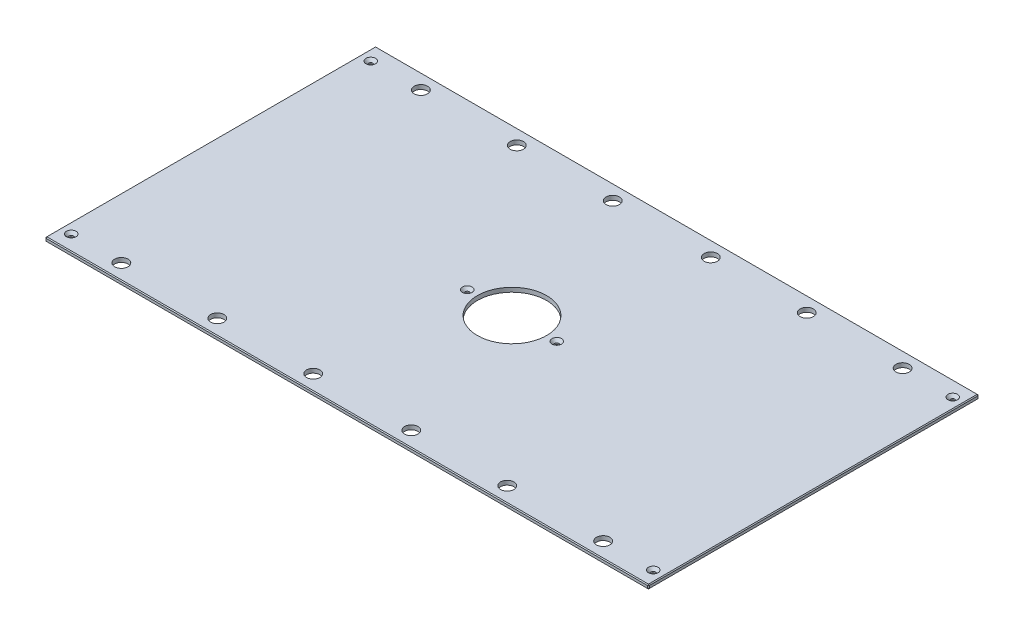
ISO-10303-21;
HEADER;
FILE_DESCRIPTION(('STEP AP214'),'2;1');
FILE_NAME('part.step','',(''),(''),'','','');
FILE_SCHEMA(('AUTOMOTIVE_DESIGN { 1 0 10303 214 1 1 1 1 }'));
ENDSEC;
DATA;
#1=APPLICATION_CONTEXT('core data for automotive mechanical design processes');
#2=APPLICATION_PROTOCOL_DEFINITION('international standard','automotive_design',2000,#1);
#3=PRODUCT_CONTEXT('',#1,'mechanical');
#4=PRODUCT('Part','Part','',(#3));
#5=PRODUCT_RELATED_PRODUCT_CATEGORY('part','',(#4));
#6=PRODUCT_DEFINITION_FORMATION('','',#4);
#7=PRODUCT_DEFINITION_CONTEXT('part definition',#1,'design');
#8=PRODUCT_DEFINITION('design','',#6,#7);
#9=PRODUCT_DEFINITION_SHAPE('','',#8);
#10=(LENGTH_UNIT() NAMED_UNIT(*) SI_UNIT(.MILLI.,.METRE.));
#11=(NAMED_UNIT(*) PLANE_ANGLE_UNIT() SI_UNIT($,.RADIAN.));
#12=(NAMED_UNIT(*) SI_UNIT($,.STERADIAN.) SOLID_ANGLE_UNIT());
#13=UNCERTAINTY_MEASURE_WITH_UNIT(LENGTH_MEASURE(1.E-05),#10,'distance_accuracy_value','');
#14=(GEOMETRIC_REPRESENTATION_CONTEXT(3) GLOBAL_UNCERTAINTY_ASSIGNED_CONTEXT((#13)) GLOBAL_UNIT_ASSIGNED_CONTEXT((#10,
#11,#12)) REPRESENTATION_CONTEXT('',''));
#15=CARTESIAN_POINT('',(0.,0.,0.));
#16=DIRECTION('',(0.,0.,1.));
#17=DIRECTION('',(1.,0.,0.));
#18=AXIS2_PLACEMENT_3D('',#15,#16,#17);
#19=CARTESIAN_POINT('',(-449.2625,6.35,-246.0625));
#20=DIRECTION('',(1.,0.,0.));
#21=DIRECTION('',(0.,0.,-1.));
#22=AXIS2_PLACEMENT_3D('',#19,#20,#21);
#23=PLANE('',#22);
#24=DIRECTION('',(0.,0.,-1.));
#25=VECTOR('',#24,1.);
#26=CARTESIAN_POINT('',(-449.2625,5.08000000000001,-246.0625));
#27=LINE('',#26,#25);
#28=CARTESIAN_POINT('',(-449.2625,5.08000000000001,244.7925));
#29=VERTEX_POINT('',#28);
#30=CARTESIAN_POINT('',(-449.2625,5.08000000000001,-244.7925));
#31=VERTEX_POINT('',#30);
#32=EDGE_CURVE('E140',#29,#31,#27,.T.);
#33=ORIENTED_EDGE('',*,*,#32,.T.);
#34=DIRECTION('',(0.,-1.,0.));
#35=VECTOR('',#34,1.);
#36=CARTESIAN_POINT('',(-449.2625,6.35,-244.7925));
#37=LINE('',#36,#35);
#38=CARTESIAN_POINT('',(-449.2625,1.26999999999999,-244.7925));
#39=VERTEX_POINT('',#38);
#40=EDGE_CURVE('E135',#31,#39,#37,.T.);
#41=ORIENTED_EDGE('',*,*,#40,.T.);
#42=DIRECTION('',(0.,0.,1.));
#43=VECTOR('',#42,1.);
#44=CARTESIAN_POINT('',(-449.2625,1.26999999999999,-246.0625));
#45=LINE('',#44,#43);
#46=CARTESIAN_POINT('',(-449.2625,1.26999999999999,244.7925));
#47=VERTEX_POINT('',#46);
#48=EDGE_CURVE('E130',#39,#47,#45,.T.);
#49=ORIENTED_EDGE('',*,*,#48,.T.);
#50=DIRECTION('',(0.,1.,0.));
#51=VECTOR('',#50,1.);
#52=CARTESIAN_POINT('',(-449.2625,6.35,244.7925));
#53=LINE('',#52,#51);
#54=EDGE_CURVE('E132',#47,#29,#53,.T.);
#55=ORIENTED_EDGE('',*,*,#54,.T.);
#56=EDGE_LOOP('',(#33,#41,#49,#55));
#57=FACE_BOUND('',#56,.T.);
#58=ADVANCED_FACE('F38',(#57),#23,.F.);
#59=CARTESIAN_POINT('',(-449.2625,6.35,246.0625));
#60=DIRECTION('',(0.,0.,-1.));
#61=DIRECTION('',(-1.,0.,0.));
#62=AXIS2_PLACEMENT_3D('',#59,#60,#61);
#63=PLANE('',#62);
#64=DIRECTION('',(1.,0.,0.));
#65=VECTOR('',#64,1.);
#66=CARTESIAN_POINT('',(-449.2625,1.26999999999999,246.0625));
#67=LINE('',#66,#65);
#68=CARTESIAN_POINT('',(-447.9925,1.26999999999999,246.0625));
#69=VERTEX_POINT('',#68);
#70=CARTESIAN_POINT('',(447.9925,1.26999999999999,246.0625));
#71=VERTEX_POINT('',#70);
#72=EDGE_CURVE('E62',#69,#71,#67,.T.);
#73=ORIENTED_EDGE('',*,*,#72,.T.);
#74=DIRECTION('',(0.,1.,0.));
#75=VECTOR('',#74,1.);
#76=CARTESIAN_POINT('',(447.9925,6.35,246.0625));
#77=LINE('',#76,#75);
#78=CARTESIAN_POINT('',(447.9925,5.08000000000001,246.0625));
#79=VERTEX_POINT('',#78);
#80=EDGE_CURVE('E11',#71,#79,#77,.T.);
#81=ORIENTED_EDGE('',*,*,#80,.T.);
#82=DIRECTION('',(-1.,0.,0.));
#83=VECTOR('',#82,1.);
#84=CARTESIAN_POINT('',(-449.2625,5.08000000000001,246.0625));
#85=LINE('',#84,#83);
#86=CARTESIAN_POINT('',(-447.9925,5.08000000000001,246.0625));
#87=VERTEX_POINT('',#86);
#88=EDGE_CURVE('E48',#79,#87,#85,.T.);
#89=ORIENTED_EDGE('',*,*,#88,.T.);
#90=DIRECTION('',(0.,-1.,0.));
#91=VECTOR('',#90,1.);
#92=CARTESIAN_POINT('',(-447.9925,6.35,246.0625));
#93=LINE('',#92,#91);
#94=EDGE_CURVE('E398',#87,#69,#93,.T.);
#95=ORIENTED_EDGE('',*,*,#94,.T.);
#96=EDGE_LOOP('',(#73,#81,#89,#95));
#97=FACE_BOUND('',#96,.T.);
#98=ADVANCED_FACE('F473',(#97),#63,.F.);
#99=CARTESIAN_POINT('',(449.2625,6.35,-246.0625));
#100=DIRECTION('',(-1.,0.,0.));
#101=DIRECTION('',(0.,0.,1.));
#102=AXIS2_PLACEMENT_3D('',#99,#100,#101);
#103=PLANE('',#102);
#104=DIRECTION('',(0.,0.,-1.));
#105=VECTOR('',#104,1.);
#106=CARTESIAN_POINT('',(449.2625,1.26999999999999,-246.0625));
#107=LINE('',#106,#105);
#108=CARTESIAN_POINT('',(449.2625,1.26999999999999,244.7925));
#109=VERTEX_POINT('',#108);
#110=CARTESIAN_POINT('',(449.2625,1.26999999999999,-244.7925));
#111=VERTEX_POINT('',#110);
#112=EDGE_CURVE('E391',#109,#111,#107,.T.);
#113=ORIENTED_EDGE('',*,*,#112,.T.);
#114=DIRECTION('',(0.,1.,0.));
#115=VECTOR('',#114,1.);
#116=CARTESIAN_POINT('',(449.2625,6.35,-244.7925));
#117=LINE('',#116,#115);
#118=CARTESIAN_POINT('',(449.2625,5.08000000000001,-244.7925));
#119=VERTEX_POINT('',#118);
#120=EDGE_CURVE('E394',#111,#119,#117,.T.);
#121=ORIENTED_EDGE('',*,*,#120,.T.);
#122=DIRECTION('',(0.,0.,1.));
#123=VECTOR('',#122,1.);
#124=CARTESIAN_POINT('',(449.2625,5.08000000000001,246.0625));
#125=LINE('',#124,#123);
#126=CARTESIAN_POINT('',(449.2625,5.08000000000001,244.7925));
#127=VERTEX_POINT('',#126);
#128=EDGE_CURVE('E388',#119,#127,#125,.T.);
#129=ORIENTED_EDGE('',*,*,#128,.T.);
#130=DIRECTION('',(0.,-1.,0.));
#131=VECTOR('',#130,1.);
#132=CARTESIAN_POINT('',(449.2625,6.35,244.7925));
#133=LINE('',#132,#131);
#134=EDGE_CURVE('E385',#127,#109,#133,.T.);
#135=ORIENTED_EDGE('',*,*,#134,.T.);
#136=EDGE_LOOP('',(#113,#121,#129,#135));
#137=FACE_BOUND('',#136,.T.);
#138=ADVANCED_FACE('F460',(#137),#103,.F.);
#139=CARTESIAN_POINT('',(-449.2625,6.35,-246.0625));
#140=DIRECTION('',(0.,0.,1.));
#141=DIRECTION('',(1.,0.,0.));
#142=AXIS2_PLACEMENT_3D('',#139,#140,#141);
#143=PLANE('',#142);
#144=DIRECTION('',(-1.,0.,0.));
#145=VECTOR('',#144,1.);
#146=CARTESIAN_POINT('',(-449.2625,1.26999999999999,-246.0625));
#147=LINE('',#146,#145);
#148=CARTESIAN_POINT('',(447.9925,1.26999999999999,-246.0625));
#149=VERTEX_POINT('',#148);
#150=CARTESIAN_POINT('',(-447.9925,1.26999999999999,-246.0625));
#151=VERTEX_POINT('',#150);
#152=EDGE_CURVE('E350',#149,#151,#147,.T.);
#153=ORIENTED_EDGE('',*,*,#152,.T.);
#154=DIRECTION('',(0.,1.,0.));
#155=VECTOR('',#154,1.);
#156=CARTESIAN_POINT('',(-447.9925,6.35,-246.0625));
#157=LINE('',#156,#155);
#158=CARTESIAN_POINT('',(-447.9925,5.08000000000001,-246.0625));
#159=VERTEX_POINT('',#158);
#160=EDGE_CURVE('E356',#151,#159,#157,.T.);
#161=ORIENTED_EDGE('',*,*,#160,.T.);
#162=DIRECTION('',(1.,0.,0.));
#163=VECTOR('',#162,1.);
#164=CARTESIAN_POINT('',(449.2625,5.08000000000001,-246.0625));
#165=LINE('',#164,#163);
#166=CARTESIAN_POINT('',(447.9925,5.08000000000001,-246.0625));
#167=VERTEX_POINT('',#166);
#168=EDGE_CURVE('E353',#159,#167,#165,.T.);
#169=ORIENTED_EDGE('',*,*,#168,.T.);
#170=DIRECTION('',(0.,-1.,0.));
#171=VECTOR('',#170,1.);
#172=CARTESIAN_POINT('',(447.9925,6.35,-246.0625));
#173=LINE('',#172,#171);
#174=EDGE_CURVE('E347',#167,#149,#173,.T.);
#175=ORIENTED_EDGE('',*,*,#174,.T.);
#176=EDGE_LOOP('',(#153,#161,#169,#175));
#177=FACE_BOUND('',#176,.T.);
#178=ADVANCED_FACE('F434',(#177),#143,.F.);
#179=CARTESIAN_POINT('',(0.,6.35,0.));
#180=DIRECTION('',(0.,1.,0.));
#181=DIRECTION('',(0.,0.,1.));
#182=AXIS2_PLACEMENT_3D('',#179,#180,#181);
#183=PLANE('',#182);
#184=CARTESIAN_POINT('',(433.3875,6.35,-223.04248));
#185=DIRECTION('',(0.,1.,0.));
#186=DIRECTION('',(0.,0.,1.));
#187=AXIS2_PLACEMENT_3D('',#184,#185,#186);
#188=CIRCLE('',#187,7.13740000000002);
#189=CARTESIAN_POINT('',(433.3875,6.35,-215.90508));
#190=VERTEX_POINT('',#189);
#191=EDGE_CURVE('E1069',#190,#190,#188,.T.);
#192=ORIENTED_EDGE('',*,*,#191,.F.);
#193=EDGE_LOOP('',(#192));
#194=FACE_BOUND('',#193,.T.);
#195=CARTESIAN_POINT('',(433.3875,6.35,223.04248));
#196=DIRECTION('',(0.,1.,0.));
#197=DIRECTION('',(0.,0.,1.));
#198=AXIS2_PLACEMENT_3D('',#195,#196,#197);
#199=CIRCLE('',#198,7.13740000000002);
#200=CARTESIAN_POINT('',(433.3875,6.35,230.17988));
#201=VERTEX_POINT('',#200);
#202=EDGE_CURVE('E1073',#201,#201,#199,.T.);
#203=ORIENTED_EDGE('',*,*,#202,.F.);
#204=EDGE_LOOP('',(#203));
#205=FACE_BOUND('',#204,.T.);
#206=CARTESIAN_POINT('',(-433.3875,6.35,223.04248));
#207=DIRECTION('',(0.,1.,0.));
#208=DIRECTION('',(0.,0.,1.));
#209=AXIS2_PLACEMENT_3D('',#206,#207,#208);
#210=CIRCLE('',#209,7.13740000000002);
#211=CARTESIAN_POINT('',(-433.3875,6.35,230.17988));
#212=VERTEX_POINT('',#211);
#213=EDGE_CURVE('E1077',#212,#212,#210,.T.);
#214=ORIENTED_EDGE('',*,*,#213,.F.);
#215=EDGE_LOOP('',(#214));
#216=FACE_BOUND('',#215,.T.);
#217=CARTESIAN_POINT('',(-66.675,6.35,0.));
#218=DIRECTION('',(0.,1.,0.));
#219=DIRECTION('',(0.,0.,1.));
#220=AXIS2_PLACEMENT_3D('',#217,#218,#219);
#221=CIRCLE('',#220,7.1374);
#222=CARTESIAN_POINT('',(-66.675,6.35,7.1374));
#223=VERTEX_POINT('',#222);
#224=EDGE_CURVE('E1081',#223,#223,#221,.T.);
#225=ORIENTED_EDGE('',*,*,#224,.F.);
#226=EDGE_LOOP('',(#225));
#227=FACE_BOUND('',#226,.T.);
#228=CARTESIAN_POINT('',(66.675,6.35,0.));
#229=DIRECTION('',(0.,1.,0.));
#230=DIRECTION('',(0.,0.,1.));
#231=AXIS2_PLACEMENT_3D('',#228,#229,#230);
#232=CIRCLE('',#231,7.1374);
#233=CARTESIAN_POINT('',(66.675,6.35,7.1374));
#234=VERTEX_POINT('',#233);
#235=EDGE_CURVE('E1085',#234,#234,#232,.T.);
#236=ORIENTED_EDGE('',*,*,#235,.F.);
#237=EDGE_LOOP('',(#236));
#238=FACE_BOUND('',#237,.T.);
#239=CARTESIAN_POINT('',(-433.3875,6.35,-223.04248));
#240=DIRECTION('',(0.,1.,0.));
#241=DIRECTION('',(0.,0.,1.));
#242=AXIS2_PLACEMENT_3D('',#239,#240,#241);
#243=CIRCLE('',#242,7.13740000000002);
#244=CARTESIAN_POINT('',(-433.3875,6.35,-215.90508));
#245=VERTEX_POINT('',#244);
#246=EDGE_CURVE('E1088',#245,#245,#243,.T.);
#247=ORIENTED_EDGE('',*,*,#246,.F.);
#248=EDGE_LOOP('',(#247));
#249=FACE_BOUND('',#248,.T.);
#250=DIRECTION('',(0.,0.,-1.));
#251=VECTOR('',#250,1.);
#252=CARTESIAN_POINT('',(447.9925,6.35,-246.0625));
#253=LINE('',#252,#251);
#254=CARTESIAN_POINT('',(447.9925,6.35,244.7925));
#255=VERTEX_POINT('',#254);
#256=CARTESIAN_POINT('',(447.9925,6.35,-244.7925));
#257=VERTEX_POINT('',#256);
#258=EDGE_CURVE('E366',#255,#257,#253,.T.);
#259=ORIENTED_EDGE('',*,*,#258,.T.);
#260=DIRECTION('',(-1.,0.,0.));
#261=VECTOR('',#260,1.);
#262=CARTESIAN_POINT('',(-449.2625,6.35,-244.7925));
#263=LINE('',#262,#261);
#264=CARTESIAN_POINT('',(-447.9925,6.35,-244.7925));
#265=VERTEX_POINT('',#264);
#266=EDGE_CURVE('E369',#257,#265,#263,.T.);
#267=ORIENTED_EDGE('',*,*,#266,.T.);
#268=DIRECTION('',(0.,0.,1.));
#269=VECTOR('',#268,1.);
#270=CARTESIAN_POINT('',(-447.9925,6.35,246.0625));
#271=LINE('',#270,#269);
#272=CARTESIAN_POINT('',(-447.9925,6.35,244.7925));
#273=VERTEX_POINT('',#272);
#274=EDGE_CURVE('E363',#265,#273,#271,.T.);
#275=ORIENTED_EDGE('',*,*,#274,.T.);
#276=DIRECTION('',(1.,0.,0.));
#277=VECTOR('',#276,1.);
#278=CARTESIAN_POINT('',(449.2625,6.35,244.7925));
#279=LINE('',#278,#277);
#280=EDGE_CURVE('E360',#273,#255,#279,.T.);
#281=ORIENTED_EDGE('',*,*,#280,.T.);
#282=EDGE_LOOP('',(#259,#267,#275,#281));
#283=FACE_BOUND('',#282,.T.);
#284=CARTESIAN_POINT('',(358.775,6.35,-223.04248));
#285=DIRECTION('',(0.,1.,0.));
#286=DIRECTION('',(0.,0.,1.));
#287=AXIS2_PLACEMENT_3D('',#284,#285,#286);
#288=CIRCLE('',#287,9.92187500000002);
#289=CARTESIAN_POINT('',(358.775,6.35,-213.120605));
#290=VERTEX_POINT('',#289);
#291=EDGE_CURVE('E231',#290,#290,#288,.T.);
#292=ORIENTED_EDGE('',*,*,#291,.F.);
#293=EDGE_LOOP('',(#292));
#294=FACE_BOUND('',#293,.T.);
#295=CARTESIAN_POINT('',(-358.775,6.35,-223.04248));
#296=DIRECTION('',(0.,1.,0.));
#297=DIRECTION('',(0.,0.,1.));
#298=AXIS2_PLACEMENT_3D('',#295,#296,#297);
#299=CIRCLE('',#298,9.92187500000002);
#300=CARTESIAN_POINT('',(-358.775,6.35,-213.120605));
#301=VERTEX_POINT('',#300);
#302=EDGE_CURVE('E246',#301,#301,#299,.T.);
#303=ORIENTED_EDGE('',*,*,#302,.F.);
#304=EDGE_LOOP('',(#303));
#305=FACE_BOUND('',#304,.T.);
#306=CARTESIAN_POINT('',(358.775,6.35,223.04248));
#307=DIRECTION('',(0.,1.,0.));
#308=DIRECTION('',(0.,0.,1.));
#309=AXIS2_PLACEMENT_3D('',#306,#307,#308);
#310=CIRCLE('',#309,9.92187500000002);
#311=CARTESIAN_POINT('',(358.775,6.35,232.964355));
#312=VERTEX_POINT('',#311);
#313=EDGE_CURVE('E258',#312,#312,#310,.T.);
#314=ORIENTED_EDGE('',*,*,#313,.F.);
#315=EDGE_LOOP('',(#314));
#316=FACE_BOUND('',#315,.T.);
#317=CARTESIAN_POINT('',(-358.775,6.35,223.04248));
#318=DIRECTION('',(0.,1.,0.));
#319=DIRECTION('',(0.,0.,1.));
#320=AXIS2_PLACEMENT_3D('',#317,#318,#319);
#321=CIRCLE('',#320,9.92187500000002);
#322=CARTESIAN_POINT('',(-358.775,6.35,232.964355));
#323=VERTEX_POINT('',#322);
#324=EDGE_CURVE('E266',#323,#323,#321,.T.);
#325=ORIENTED_EDGE('',*,*,#324,.F.);
#326=EDGE_LOOP('',(#325));
#327=FACE_BOUND('',#326,.T.);
#328=CARTESIAN_POINT('',(-215.9,6.35,-223.04248));
#329=DIRECTION('',(0.,1.,0.));
#330=DIRECTION('',(0.,0.,1.));
#331=AXIS2_PLACEMENT_3D('',#328,#329,#330);
#332=CIRCLE('',#331,9.921875);
#333=CARTESIAN_POINT('',(-215.9,6.35,-213.120605));
#334=VERTEX_POINT('',#333);
#335=EDGE_CURVE('E273',#334,#334,#332,.T.);
#336=ORIENTED_EDGE('',*,*,#335,.F.);
#337=EDGE_LOOP('',(#336));
#338=FACE_BOUND('',#337,.T.);
#339=CARTESIAN_POINT('',(215.9,6.35,-223.04248));
#340=DIRECTION('',(0.,1.,0.));
#341=DIRECTION('',(0.,0.,1.));
#342=AXIS2_PLACEMENT_3D('',#339,#340,#341);
#343=CIRCLE('',#342,9.921875);
#344=CARTESIAN_POINT('',(215.9,6.35,-213.120605));
#345=VERTEX_POINT('',#344);
#346=EDGE_CURVE('E280',#345,#345,#343,.T.);
#347=ORIENTED_EDGE('',*,*,#346,.F.);
#348=EDGE_LOOP('',(#347));
#349=FACE_BOUND('',#348,.T.);
#350=CARTESIAN_POINT('',(215.9,6.35,223.04248));
#351=DIRECTION('',(0.,1.,0.));
#352=DIRECTION('',(0.,0.,1.));
#353=AXIS2_PLACEMENT_3D('',#350,#351,#352);
#354=CIRCLE('',#353,9.921875);
#355=CARTESIAN_POINT('',(215.9,6.35,232.964355));
#356=VERTEX_POINT('',#355);
#357=EDGE_CURVE('E288',#356,#356,#354,.T.);
#358=ORIENTED_EDGE('',*,*,#357,.F.);
#359=EDGE_LOOP('',(#358));
#360=FACE_BOUND('',#359,.T.);
#361=CARTESIAN_POINT('',(-215.9,6.35,223.04248));
#362=DIRECTION('',(0.,1.,0.));
#363=DIRECTION('',(0.,0.,1.));
#364=AXIS2_PLACEMENT_3D('',#361,#362,#363);
#365=CIRCLE('',#364,9.921875);
#366=CARTESIAN_POINT('',(-215.9,6.35,232.964355));
#367=VERTEX_POINT('',#366);
#368=EDGE_CURVE('E296',#367,#367,#365,.T.);
#369=ORIENTED_EDGE('',*,*,#368,.F.);
#370=EDGE_LOOP('',(#369));
#371=FACE_BOUND('',#370,.T.);
#372=CARTESIAN_POINT('',(73.025,6.35,-223.04248));
#373=DIRECTION('',(0.,1.,0.));
#374=DIRECTION('',(0.,0.,1.));
#375=AXIS2_PLACEMENT_3D('',#372,#373,#374);
#376=CIRCLE('',#375,9.921875);
#377=CARTESIAN_POINT('',(73.025,6.35,-213.120605));
#378=VERTEX_POINT('',#377);
#379=EDGE_CURVE('E304',#378,#378,#376,.T.);
#380=ORIENTED_EDGE('',*,*,#379,.F.);
#381=EDGE_LOOP('',(#380));
#382=FACE_BOUND('',#381,.T.);
#383=CARTESIAN_POINT('',(-73.025,6.35,-223.04248));
#384=DIRECTION('',(0.,1.,0.));
#385=DIRECTION('',(0.,0.,1.));
#386=AXIS2_PLACEMENT_3D('',#383,#384,#385);
#387=CIRCLE('',#386,9.921875);
#388=CARTESIAN_POINT('',(-73.025,6.35,-213.120605));
#389=VERTEX_POINT('',#388);
#390=EDGE_CURVE('E312',#389,#389,#387,.T.);
#391=ORIENTED_EDGE('',*,*,#390,.F.);
#392=EDGE_LOOP('',(#391));
#393=FACE_BOUND('',#392,.T.);
#394=CARTESIAN_POINT('',(-73.025,6.35,223.04248));
#395=DIRECTION('',(0.,1.,0.));
#396=DIRECTION('',(0.,0.,1.));
#397=AXIS2_PLACEMENT_3D('',#394,#395,#396);
#398=CIRCLE('',#397,9.921875);
#399=CARTESIAN_POINT('',(-73.025,6.35,232.964355));
#400=VERTEX_POINT('',#399);
#401=EDGE_CURVE('E320',#400,#400,#398,.T.);
#402=ORIENTED_EDGE('',*,*,#401,.F.);
#403=EDGE_LOOP('',(#402));
#404=FACE_BOUND('',#403,.T.);
#405=CARTESIAN_POINT('',(73.025,6.35,223.04248));
#406=DIRECTION('',(0.,1.,0.));
#407=DIRECTION('',(0.,0.,1.));
#408=AXIS2_PLACEMENT_3D('',#405,#406,#407);
#409=CIRCLE('',#408,9.921875);
#410=CARTESIAN_POINT('',(73.025,6.35,232.964355));
#411=VERTEX_POINT('',#410);
#412=EDGE_CURVE('E328',#411,#411,#409,.T.);
#413=ORIENTED_EDGE('',*,*,#412,.F.);
#414=EDGE_LOOP('',(#413));
#415=FACE_BOUND('',#414,.T.);
#416=CARTESIAN_POINT('',(0.,6.35,0.));
#417=DIRECTION('',(0.,1.,0.));
#418=DIRECTION('',(0.,0.,1.));
#419=AXIS2_PLACEMENT_3D('',#416,#417,#418);
#420=CIRCLE('',#419,51.562);
#421=CARTESIAN_POINT('',(0.,6.35,51.562));
#422=VERTEX_POINT('',#421);
#423=EDGE_CURVE('E336',#422,#422,#420,.T.);
#424=ORIENTED_EDGE('',*,*,#423,.F.);
#425=EDGE_LOOP('',(#424));
#426=FACE_BOUND('',#425,.T.);
#427=ADVANCED_FACE('F482',(#194,#205,#216,#227,#238,#249,#283,#294,#305,#316,#327,#338,#349,
#360,#371,#382,#393,#404,#415,#426),#183,.T.);
#428=CARTESIAN_POINT('',(0.,0.,0.));
#429=DIRECTION('',(0.,1.,0.));
#430=DIRECTION('',(0.,0.,1.));
#431=AXIS2_PLACEMENT_3D('',#428,#429,#430);
#432=PLANE('',#431);
#433=CARTESIAN_POINT('',(433.3875,0.,-223.04248));
#434=DIRECTION('',(0.,1.,0.));
#435=DIRECTION('',(0.,0.,1.));
#436=AXIS2_PLACEMENT_3D('',#433,#434,#435);
#437=CIRCLE('',#436,3.3782);
#438=CARTESIAN_POINT('',(433.3875,0.,-219.66428));
#439=VERTEX_POINT('',#438);
#440=EDGE_CURVE('E1137',#439,#439,#437,.T.);
#441=ORIENTED_EDGE('',*,*,#440,.T.);
#442=EDGE_LOOP('',(#441));
#443=FACE_BOUND('',#442,.T.);
#444=CARTESIAN_POINT('',(433.3875,0.,223.04248));
#445=DIRECTION('',(0.,1.,0.));
#446=DIRECTION('',(0.,0.,1.));
#447=AXIS2_PLACEMENT_3D('',#444,#445,#446);
#448=CIRCLE('',#447,3.3782);
#449=CARTESIAN_POINT('',(433.3875,0.,226.42068));
#450=VERTEX_POINT('',#449);
#451=EDGE_CURVE('E1127',#450,#450,#448,.T.);
#452=ORIENTED_EDGE('',*,*,#451,.T.);
#453=EDGE_LOOP('',(#452));
#454=FACE_BOUND('',#453,.T.);
#455=CARTESIAN_POINT('',(-433.3875,0.,223.04248));
#456=DIRECTION('',(0.,1.,0.));
#457=DIRECTION('',(0.,0.,1.));
#458=AXIS2_PLACEMENT_3D('',#455,#456,#457);
#459=CIRCLE('',#458,3.3782);
#460=CARTESIAN_POINT('',(-433.3875,0.,226.42068));
#461=VERTEX_POINT('',#460);
#462=EDGE_CURVE('E1117',#461,#461,#459,.T.);
#463=ORIENTED_EDGE('',*,*,#462,.T.);
#464=EDGE_LOOP('',(#463));
#465=FACE_BOUND('',#464,.T.);
#466=CARTESIAN_POINT('',(-66.675,0.,0.));
#467=DIRECTION('',(0.,1.,0.));
#468=DIRECTION('',(0.,0.,1.));
#469=AXIS2_PLACEMENT_3D('',#466,#467,#468);
#470=CIRCLE('',#469,3.3782);
#471=CARTESIAN_POINT('',(-66.675,0.,3.3782));
#472=VERTEX_POINT('',#471);
#473=EDGE_CURVE('E1107',#472,#472,#470,.T.);
#474=ORIENTED_EDGE('',*,*,#473,.T.);
#475=EDGE_LOOP('',(#474));
#476=FACE_BOUND('',#475,.T.);
#477=CARTESIAN_POINT('',(66.675,0.,0.));
#478=DIRECTION('',(0.,1.,0.));
#479=DIRECTION('',(0.,0.,1.));
#480=AXIS2_PLACEMENT_3D('',#477,#478,#479);
#481=CIRCLE('',#480,3.3782);
#482=CARTESIAN_POINT('',(66.675,0.,3.3782));
#483=VERTEX_POINT('',#482);
#484=EDGE_CURVE('E1092',#483,#483,#481,.T.);
#485=ORIENTED_EDGE('',*,*,#484,.T.);
#486=EDGE_LOOP('',(#485));
#487=FACE_BOUND('',#486,.T.);
#488=CARTESIAN_POINT('',(-433.3875,0.,-223.04248));
#489=DIRECTION('',(0.,1.,0.));
#490=DIRECTION('',(0.,0.,1.));
#491=AXIS2_PLACEMENT_3D('',#488,#489,#490);
#492=CIRCLE('',#491,3.3782);
#493=CARTESIAN_POINT('',(-433.3875,0.,-219.66428));
#494=VERTEX_POINT('',#493);
#495=EDGE_CURVE('E249',#494,#494,#492,.T.);
#496=ORIENTED_EDGE('',*,*,#495,.T.);
#497=EDGE_LOOP('',(#496));
#498=FACE_BOUND('',#497,.T.);
#499=DIRECTION('',(0.,0.,-1.));
#500=VECTOR('',#499,1.);
#501=CARTESIAN_POINT('',(-447.9925,0.,0.));
#502=LINE('',#501,#500);
#503=CARTESIAN_POINT('',(-447.9925,0.,244.7925));
#504=VERTEX_POINT('',#503);
#505=CARTESIAN_POINT('',(-447.9925,0.,-244.7925));
#506=VERTEX_POINT('',#505);
#507=EDGE_CURVE('E165',#504,#506,#502,.T.);
#508=ORIENTED_EDGE('',*,*,#507,.T.);
#509=DIRECTION('',(1.,0.,0.));
#510=VECTOR('',#509,1.);
#511=CARTESIAN_POINT('',(0.,0.,-244.7925));
#512=LINE('',#511,#510);
#513=CARTESIAN_POINT('',(447.9925,0.,-244.7925));
#514=VERTEX_POINT('',#513);
#515=EDGE_CURVE('E381',#506,#514,#512,.T.);
#516=ORIENTED_EDGE('',*,*,#515,.T.);
#517=DIRECTION('',(0.,0.,1.));
#518=VECTOR('',#517,1.);
#519=CARTESIAN_POINT('',(447.9925,0.,0.));
#520=LINE('',#519,#518);
#521=CARTESIAN_POINT('',(447.9925,0.,244.7925));
#522=VERTEX_POINT('',#521);
#523=EDGE_CURVE('E378',#514,#522,#520,.T.);
#524=ORIENTED_EDGE('',*,*,#523,.T.);
#525=DIRECTION('',(-1.,0.,0.));
#526=VECTOR('',#525,1.);
#527=CARTESIAN_POINT('',(0.,0.,244.7925));
#528=LINE('',#527,#526);
#529=EDGE_CURVE('E373',#522,#504,#528,.T.);
#530=ORIENTED_EDGE('',*,*,#529,.T.);
#531=EDGE_LOOP('',(#508,#516,#524,#530));
#532=FACE_BOUND('',#531,.T.);
#533=CARTESIAN_POINT('',(358.775,0.,-223.04248));
#534=DIRECTION('',(0.,1.,0.));
#535=DIRECTION('',(0.,0.,1.));
#536=AXIS2_PLACEMENT_3D('',#533,#534,#535);
#537=CIRCLE('',#536,9.92187499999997);
#538=CARTESIAN_POINT('',(358.775,0.,-213.120605));
#539=VERTEX_POINT('',#538);
#540=EDGE_CURVE('E239',#539,#539,#537,.T.);
#541=ORIENTED_EDGE('',*,*,#540,.T.);
#542=EDGE_LOOP('',(#541));
#543=FACE_BOUND('',#542,.T.);
#544=CARTESIAN_POINT('',(-358.775,0.,-223.04248));
#545=DIRECTION('',(0.,1.,0.));
#546=DIRECTION('',(0.,0.,1.));
#547=AXIS2_PLACEMENT_3D('',#544,#545,#546);
#548=CIRCLE('',#547,9.92187499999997);
#549=CARTESIAN_POINT('',(-358.775,0.,-213.120605));
#550=VERTEX_POINT('',#549);
#551=EDGE_CURVE('E254',#550,#550,#548,.T.);
#552=ORIENTED_EDGE('',*,*,#551,.T.);
#553=EDGE_LOOP('',(#552));
#554=FACE_BOUND('',#553,.T.);
#555=CARTESIAN_POINT('',(358.775,0.,223.04248));
#556=DIRECTION('',(0.,1.,0.));
#557=DIRECTION('',(0.,0.,1.));
#558=AXIS2_PLACEMENT_3D('',#555,#556,#557);
#559=CIRCLE('',#558,9.92187499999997);
#560=CARTESIAN_POINT('',(358.775,0.,232.964355));
#561=VERTEX_POINT('',#560);
#562=EDGE_CURVE('E262',#561,#561,#559,.T.);
#563=ORIENTED_EDGE('',*,*,#562,.T.);
#564=EDGE_LOOP('',(#563));
#565=FACE_BOUND('',#564,.T.);
#566=CARTESIAN_POINT('',(-358.775,0.,223.04248));
#567=DIRECTION('',(0.,1.,0.));
#568=DIRECTION('',(0.,0.,1.));
#569=AXIS2_PLACEMENT_3D('',#566,#567,#568);
#570=CIRCLE('',#569,9.92187499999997);
#571=CARTESIAN_POINT('',(-358.775,0.,232.964355));
#572=VERTEX_POINT('',#571);
#573=EDGE_CURVE('E270',#572,#572,#570,.T.);
#574=ORIENTED_EDGE('',*,*,#573,.T.);
#575=EDGE_LOOP('',(#574));
#576=FACE_BOUND('',#575,.T.);
#577=CARTESIAN_POINT('',(-215.9,0.,-223.04248));
#578=DIRECTION('',(0.,1.,0.));
#579=DIRECTION('',(0.,0.,1.));
#580=AXIS2_PLACEMENT_3D('',#577,#578,#579);
#581=CIRCLE('',#580,9.921875);
#582=CARTESIAN_POINT('',(-215.9,0.,-213.120605));
#583=VERTEX_POINT('',#582);
#584=EDGE_CURVE('E277',#583,#583,#581,.T.);
#585=ORIENTED_EDGE('',*,*,#584,.T.);
#586=EDGE_LOOP('',(#585));
#587=FACE_BOUND('',#586,.T.);
#588=CARTESIAN_POINT('',(215.9,0.,-223.04248));
#589=DIRECTION('',(0.,1.,0.));
#590=DIRECTION('',(0.,0.,1.));
#591=AXIS2_PLACEMENT_3D('',#588,#589,#590);
#592=CIRCLE('',#591,9.921875);
#593=CARTESIAN_POINT('',(215.9,0.,-213.120605));
#594=VERTEX_POINT('',#593);
#595=EDGE_CURVE('E284',#594,#594,#592,.T.);
#596=ORIENTED_EDGE('',*,*,#595,.T.);
#597=EDGE_LOOP('',(#596));
#598=FACE_BOUND('',#597,.T.);
#599=CARTESIAN_POINT('',(215.9,0.,223.04248));
#600=DIRECTION('',(0.,1.,0.));
#601=DIRECTION('',(0.,0.,1.));
#602=AXIS2_PLACEMENT_3D('',#599,#600,#601);
#603=CIRCLE('',#602,9.921875);
#604=CARTESIAN_POINT('',(215.9,0.,232.964355));
#605=VERTEX_POINT('',#604);
#606=EDGE_CURVE('E292',#605,#605,#603,.T.);
#607=ORIENTED_EDGE('',*,*,#606,.T.);
#608=EDGE_LOOP('',(#607));
#609=FACE_BOUND('',#608,.T.);
#610=CARTESIAN_POINT('',(-215.9,0.,223.04248));
#611=DIRECTION('',(0.,1.,0.));
#612=DIRECTION('',(0.,0.,1.));
#613=AXIS2_PLACEMENT_3D('',#610,#611,#612);
#614=CIRCLE('',#613,9.921875);
#615=CARTESIAN_POINT('',(-215.9,0.,232.964355));
#616=VERTEX_POINT('',#615);
#617=EDGE_CURVE('E300',#616,#616,#614,.T.);
#618=ORIENTED_EDGE('',*,*,#617,.T.);
#619=EDGE_LOOP('',(#618));
#620=FACE_BOUND('',#619,.T.);
#621=CARTESIAN_POINT('',(73.025,0.,-223.04248));
#622=DIRECTION('',(0.,1.,0.));
#623=DIRECTION('',(0.,0.,1.));
#624=AXIS2_PLACEMENT_3D('',#621,#622,#623);
#625=CIRCLE('',#624,9.921875);
#626=CARTESIAN_POINT('',(73.025,0.,-213.120605));
#627=VERTEX_POINT('',#626);
#628=EDGE_CURVE('E308',#627,#627,#625,.T.);
#629=ORIENTED_EDGE('',*,*,#628,.T.);
#630=EDGE_LOOP('',(#629));
#631=FACE_BOUND('',#630,.T.);
#632=CARTESIAN_POINT('',(-73.025,0.,-223.04248));
#633=DIRECTION('',(0.,1.,0.));
#634=DIRECTION('',(0.,0.,1.));
#635=AXIS2_PLACEMENT_3D('',#632,#633,#634);
#636=CIRCLE('',#635,9.921875);
#637=CARTESIAN_POINT('',(-73.025,0.,-213.120605));
#638=VERTEX_POINT('',#637);
#639=EDGE_CURVE('E316',#638,#638,#636,.T.);
#640=ORIENTED_EDGE('',*,*,#639,.T.);
#641=EDGE_LOOP('',(#640));
#642=FACE_BOUND('',#641,.T.);
#643=CARTESIAN_POINT('',(-73.025,0.,223.04248));
#644=DIRECTION('',(0.,1.,0.));
#645=DIRECTION('',(0.,0.,1.));
#646=AXIS2_PLACEMENT_3D('',#643,#644,#645);
#647=CIRCLE('',#646,9.921875);
#648=CARTESIAN_POINT('',(-73.025,0.,232.964355));
#649=VERTEX_POINT('',#648);
#650=EDGE_CURVE('E324',#649,#649,#647,.T.);
#651=ORIENTED_EDGE('',*,*,#650,.T.);
#652=EDGE_LOOP('',(#651));
#653=FACE_BOUND('',#652,.T.);
#654=CARTESIAN_POINT('',(73.025,0.,223.04248));
#655=DIRECTION('',(0.,1.,0.));
#656=DIRECTION('',(0.,0.,1.));
#657=AXIS2_PLACEMENT_3D('',#654,#655,#656);
#658=CIRCLE('',#657,9.921875);
#659=CARTESIAN_POINT('',(73.025,0.,232.964355));
#660=VERTEX_POINT('',#659);
#661=EDGE_CURVE('E332',#660,#660,#658,.T.);
#662=ORIENTED_EDGE('',*,*,#661,.T.);
#663=EDGE_LOOP('',(#662));
#664=FACE_BOUND('',#663,.T.);
#665=CARTESIAN_POINT('',(0.,0.,0.));
#666=DIRECTION('',(0.,1.,0.));
#667=DIRECTION('',(0.,0.,1.));
#668=AXIS2_PLACEMENT_3D('',#665,#666,#667);
#669=CIRCLE('',#668,51.562);
#670=CARTESIAN_POINT('',(0.,0.,51.562));
#671=VERTEX_POINT('',#670);
#672=EDGE_CURVE('E153',#671,#671,#669,.T.);
#673=ORIENTED_EDGE('',*,*,#672,.T.);
#674=EDGE_LOOP('',(#673));
#675=FACE_BOUND('',#674,.T.);
#676=ADVANCED_FACE('F447',(#443,#454,#465,#476,#487,#498,#532,#543,#554,#565,#576,#587,#598,
#609,#620,#631,#642,#653,#664,#675),#432,.F.);
#677=CARTESIAN_POINT('',(0.,0.,0.));
#678=DIRECTION('',(0.,1.,0.));
#679=DIRECTION('',(0.,0.,1.));
#680=AXIS2_PLACEMENT_3D('',#677,#678,#679);
#681=CYLINDRICAL_SURFACE('',#680,51.562);
#682=ORIENTED_EDGE('',*,*,#672,.F.);
#683=EDGE_LOOP('',(#682));
#684=FACE_BOUND('',#683,.T.);
#685=ORIENTED_EDGE('',*,*,#423,.T.);
#686=EDGE_LOOP('',(#685));
#687=FACE_BOUND('',#686,.T.);
#688=ADVANCED_FACE('F728',(#684,#687),#681,.F.);
#689=CARTESIAN_POINT('',(73.025,6.35,223.04248));
#690=DIRECTION('',(0.,1.,0.));
#691=DIRECTION('',(0.,0.,1.));
#692=AXIS2_PLACEMENT_3D('',#689,#690,#691);
#693=CYLINDRICAL_SURFACE('',#692,9.921875);
#694=ORIENTED_EDGE('',*,*,#661,.F.);
#695=EDGE_LOOP('',(#694));
#696=FACE_BOUND('',#695,.T.);
#697=ORIENTED_EDGE('',*,*,#412,.T.);
#698=EDGE_LOOP('',(#697));
#699=FACE_BOUND('',#698,.T.);
#700=ADVANCED_FACE('F962',(#696,#699),#693,.F.);
#701=CARTESIAN_POINT('',(-73.025,6.35,223.04248));
#702=DIRECTION('',(0.,1.,0.));
#703=DIRECTION('',(0.,0.,1.));
#704=AXIS2_PLACEMENT_3D('',#701,#702,#703);
#705=CYLINDRICAL_SURFACE('',#704,9.921875);
#706=ORIENTED_EDGE('',*,*,#650,.F.);
#707=EDGE_LOOP('',(#706));
#708=FACE_BOUND('',#707,.T.);
#709=ORIENTED_EDGE('',*,*,#401,.T.);
#710=EDGE_LOOP('',(#709));
#711=FACE_BOUND('',#710,.T.);
#712=ADVANCED_FACE('F952',(#708,#711),#705,.F.);
#713=CARTESIAN_POINT('',(-73.025,6.35,-223.04248));
#714=DIRECTION('',(0.,1.,0.));
#715=DIRECTION('',(0.,0.,1.));
#716=AXIS2_PLACEMENT_3D('',#713,#714,#715);
#717=CYLINDRICAL_SURFACE('',#716,9.921875);
#718=ORIENTED_EDGE('',*,*,#639,.F.);
#719=EDGE_LOOP('',(#718));
#720=FACE_BOUND('',#719,.T.);
#721=ORIENTED_EDGE('',*,*,#390,.T.);
#722=EDGE_LOOP('',(#721));
#723=FACE_BOUND('',#722,.T.);
#724=ADVANCED_FACE('F942',(#720,#723),#717,.F.);
#725=CARTESIAN_POINT('',(73.025,6.35,-223.04248));
#726=DIRECTION('',(0.,1.,0.));
#727=DIRECTION('',(0.,0.,1.));
#728=AXIS2_PLACEMENT_3D('',#725,#726,#727);
#729=CYLINDRICAL_SURFACE('',#728,9.921875);
#730=ORIENTED_EDGE('',*,*,#628,.F.);
#731=EDGE_LOOP('',(#730));
#732=FACE_BOUND('',#731,.T.);
#733=ORIENTED_EDGE('',*,*,#379,.T.);
#734=EDGE_LOOP('',(#733));
#735=FACE_BOUND('',#734,.T.);
#736=ADVANCED_FACE('F932',(#732,#735),#729,.F.);
#737=CARTESIAN_POINT('',(-215.9,6.35,223.04248));
#738=DIRECTION('',(0.,1.,0.));
#739=DIRECTION('',(0.,0.,1.));
#740=AXIS2_PLACEMENT_3D('',#737,#738,#739);
#741=CYLINDRICAL_SURFACE('',#740,9.921875);
#742=ORIENTED_EDGE('',*,*,#617,.F.);
#743=EDGE_LOOP('',(#742));
#744=FACE_BOUND('',#743,.T.);
#745=ORIENTED_EDGE('',*,*,#368,.T.);
#746=EDGE_LOOP('',(#745));
#747=FACE_BOUND('',#746,.T.);
#748=ADVANCED_FACE('F922',(#744,#747),#741,.F.);
#749=CARTESIAN_POINT('',(215.9,6.35,223.04248));
#750=DIRECTION('',(0.,1.,0.));
#751=DIRECTION('',(0.,0.,1.));
#752=AXIS2_PLACEMENT_3D('',#749,#750,#751);
#753=CYLINDRICAL_SURFACE('',#752,9.921875);
#754=ORIENTED_EDGE('',*,*,#606,.F.);
#755=EDGE_LOOP('',(#754));
#756=FACE_BOUND('',#755,.T.);
#757=ORIENTED_EDGE('',*,*,#357,.T.);
#758=EDGE_LOOP('',(#757));
#759=FACE_BOUND('',#758,.T.);
#760=ADVANCED_FACE('F912',(#756,#759),#753,.F.);
#761=CARTESIAN_POINT('',(215.9,6.35,-223.04248));
#762=DIRECTION('',(0.,1.,0.));
#763=DIRECTION('',(0.,0.,1.));
#764=AXIS2_PLACEMENT_3D('',#761,#762,#763);
#765=CYLINDRICAL_SURFACE('',#764,9.921875);
#766=ORIENTED_EDGE('',*,*,#595,.F.);
#767=EDGE_LOOP('',(#766));
#768=FACE_BOUND('',#767,.T.);
#769=ORIENTED_EDGE('',*,*,#346,.T.);
#770=EDGE_LOOP('',(#769));
#771=FACE_BOUND('',#770,.T.);
#772=ADVANCED_FACE('F902',(#768,#771),#765,.F.);
#773=CARTESIAN_POINT('',(-215.9,6.35,-223.04248));
#774=DIRECTION('',(0.,1.,0.));
#775=DIRECTION('',(0.,0.,1.));
#776=AXIS2_PLACEMENT_3D('',#773,#774,#775);
#777=CYLINDRICAL_SURFACE('',#776,9.921875);
#778=ORIENTED_EDGE('',*,*,#584,.F.);
#779=EDGE_LOOP('',(#778));
#780=FACE_BOUND('',#779,.T.);
#781=ORIENTED_EDGE('',*,*,#335,.T.);
#782=EDGE_LOOP('',(#781));
#783=FACE_BOUND('',#782,.T.);
#784=ADVANCED_FACE('F892',(#780,#783),#777,.F.);
#785=CARTESIAN_POINT('',(-358.775,6.35,223.04248));
#786=DIRECTION('',(0.,1.,0.));
#787=DIRECTION('',(0.,0.,1.));
#788=AXIS2_PLACEMENT_3D('',#785,#786,#787);
#789=CYLINDRICAL_SURFACE('',#788,9.921875);
#790=ORIENTED_EDGE('',*,*,#573,.F.);
#791=EDGE_LOOP('',(#790));
#792=FACE_BOUND('',#791,.T.);
#793=ORIENTED_EDGE('',*,*,#324,.T.);
#794=EDGE_LOOP('',(#793));
#795=FACE_BOUND('',#794,.T.);
#796=ADVANCED_FACE('F882',(#792,#795),#789,.F.);
#797=CARTESIAN_POINT('',(358.775,6.35,223.04248));
#798=DIRECTION('',(0.,1.,0.));
#799=DIRECTION('',(0.,0.,1.));
#800=AXIS2_PLACEMENT_3D('',#797,#798,#799);
#801=CYLINDRICAL_SURFACE('',#800,9.921875);
#802=ORIENTED_EDGE('',*,*,#562,.F.);
#803=EDGE_LOOP('',(#802));
#804=FACE_BOUND('',#803,.T.);
#805=ORIENTED_EDGE('',*,*,#313,.T.);
#806=EDGE_LOOP('',(#805));
#807=FACE_BOUND('',#806,.T.);
#808=ADVANCED_FACE('F872',(#804,#807),#801,.F.);
#809=CARTESIAN_POINT('',(-358.775,6.35,-223.04248));
#810=DIRECTION('',(0.,1.,0.));
#811=DIRECTION('',(0.,0.,1.));
#812=AXIS2_PLACEMENT_3D('',#809,#810,#811);
#813=CYLINDRICAL_SURFACE('',#812,9.921875);
#814=ORIENTED_EDGE('',*,*,#551,.F.);
#815=EDGE_LOOP('',(#814));
#816=FACE_BOUND('',#815,.T.);
#817=ORIENTED_EDGE('',*,*,#302,.T.);
#818=EDGE_LOOP('',(#817));
#819=FACE_BOUND('',#818,.T.);
#820=ADVANCED_FACE('F862',(#816,#819),#813,.F.);
#821=CARTESIAN_POINT('',(358.775,6.35,-223.04248));
#822=DIRECTION('',(0.,1.,0.));
#823=DIRECTION('',(0.,0.,1.));
#824=AXIS2_PLACEMENT_3D('',#821,#822,#823);
#825=CYLINDRICAL_SURFACE('',#824,9.921875);
#826=ORIENTED_EDGE('',*,*,#540,.F.);
#827=EDGE_LOOP('',(#826));
#828=FACE_BOUND('',#827,.T.);
#829=ORIENTED_EDGE('',*,*,#291,.T.);
#830=EDGE_LOOP('',(#829));
#831=FACE_BOUND('',#830,.T.);
#832=ADVANCED_FACE('F491',(#828,#831),#825,.F.);
#833=CARTESIAN_POINT('',(449.2625,6.35,244.7925));
#834=DIRECTION('',(-0.707106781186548,0.,-0.707106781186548));
#835=DIRECTION('',(0.,-1.,0.));
#836=AXIS2_PLACEMENT_3D('',#833,#834,#835);
#837=PLANE('',#836);
#838=DIRECTION('',(-0.707106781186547,0.,0.707106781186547));
#839=VECTOR('',#838,1.);
#840=CARTESIAN_POINT('',(449.2625,5.08000000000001,244.7925));
#841=LINE('',#840,#839);
#842=EDGE_CURVE('E42',#79,#127,#841,.F.);
#843=ORIENTED_EDGE('',*,*,#842,.F.);
#844=ORIENTED_EDGE('',*,*,#80,.F.);
#845=DIRECTION('',(0.707106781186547,0.,-0.707106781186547));
#846=VECTOR('',#845,1.);
#847=CARTESIAN_POINT('',(448.6275,1.26999999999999,245.4275));
#848=LINE('',#847,#846);
#849=EDGE_CURVE('E220',#109,#71,#848,.F.);
#850=ORIENTED_EDGE('',*,*,#849,.F.);
#851=ORIENTED_EDGE('',*,*,#134,.F.);
#852=EDGE_LOOP('',(#843,#844,#850,#851));
#853=FACE_BOUND('',#852,.T.);
#854=ADVANCED_FACE('F40',(#853),#837,.F.);
#855=CARTESIAN_POINT('',(449.2625,5.08000000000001,244.7925));
#856=DIRECTION('',(0.577350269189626,0.577350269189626,0.577350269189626));
#857=DIRECTION('',(0.707106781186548,0.,-0.707106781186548));
#858=AXIS2_PLACEMENT_3D('',#855,#856,#857);
#859=PLANE('',#858);
#860=DIRECTION('',(0.,-0.707106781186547,0.707106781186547));
#861=VECTOR('',#860,1.);
#862=CARTESIAN_POINT('',(447.9925,5.715,245.4275));
#863=LINE('',#862,#861);
#864=EDGE_CURVE('E215',#79,#255,#863,.F.);
#865=ORIENTED_EDGE('',*,*,#864,.F.);
#866=ORIENTED_EDGE('',*,*,#842,.T.);
#867=DIRECTION('',(-0.707106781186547,0.707106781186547,0.));
#868=VECTOR('',#867,1.);
#869=CARTESIAN_POINT('',(449.2625,5.08000000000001,244.7925));
#870=LINE('',#869,#868);
#871=EDGE_CURVE('E218',#255,#127,#870,.F.);
#872=ORIENTED_EDGE('',*,*,#871,.F.);
#873=EDGE_LOOP('',(#865,#866,#872));
#874=FACE_BOUND('',#873,.T.);
#875=ADVANCED_FACE('F484',(#874),#859,.T.);
#876=CARTESIAN_POINT('',(447.9925,0.,244.7925));
#877=DIRECTION('',(0.577350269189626,-0.577350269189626,0.577350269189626));
#878=DIRECTION('',(0.707106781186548,0.,-0.707106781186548));
#879=AXIS2_PLACEMENT_3D('',#876,#877,#878);
#880=PLANE('',#879);
#881=DIRECTION('',(-0.707106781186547,-0.707106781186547,0.));
#882=VECTOR('',#881,1.);
#883=CARTESIAN_POINT('',(447.9925,0.,244.7925));
#884=LINE('',#883,#882);
#885=EDGE_CURVE('E207',#109,#522,#884,.T.);
#886=ORIENTED_EDGE('',*,*,#885,.F.);
#887=ORIENTED_EDGE('',*,*,#849,.T.);
#888=DIRECTION('',(0.,0.707106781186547,0.707106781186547));
#889=VECTOR('',#888,1.);
#890=CARTESIAN_POINT('',(447.9925,0.,244.7925));
#891=LINE('',#890,#889);
#892=EDGE_CURVE('E211',#522,#71,#891,.T.);
#893=ORIENTED_EDGE('',*,*,#892,.F.);
#894=EDGE_LOOP('',(#886,#887,#893));
#895=FACE_BOUND('',#894,.T.);
#896=ADVANCED_FACE('F453',(#895),#880,.T.);
#897=CARTESIAN_POINT('',(447.9925,6.35,0.));
#898=DIRECTION('',(0.707106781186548,0.707106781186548,0.));
#899=DIRECTION('',(0.,0.,1.));
#900=AXIS2_PLACEMENT_3D('',#897,#898,#899);
#901=PLANE('',#900);
#902=ORIENTED_EDGE('',*,*,#871,.T.);
#903=ORIENTED_EDGE('',*,*,#128,.F.);
#904=DIRECTION('',(0.707106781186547,-0.707106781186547,0.));
#905=VECTOR('',#904,1.);
#906=CARTESIAN_POINT('',(448.6275,5.715,-244.7925));
#907=LINE('',#906,#905);
#908=EDGE_CURVE('E200',#257,#119,#907,.T.);
#909=ORIENTED_EDGE('',*,*,#908,.F.);
#910=ORIENTED_EDGE('',*,*,#258,.F.);
#911=EDGE_LOOP('',(#902,#903,#909,#910));
#912=FACE_BOUND('',#911,.T.);
#913=ADVANCED_FACE('F470',(#912),#901,.T.);
#914=CARTESIAN_POINT('',(0.,6.35,244.7925));
#915=DIRECTION('',(0.,0.707106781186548,0.707106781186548));
#916=DIRECTION('',(-1.,0.,0.));
#917=AXIS2_PLACEMENT_3D('',#914,#915,#916);
#918=PLANE('',#917);
#919=ORIENTED_EDGE('',*,*,#864,.T.);
#920=ORIENTED_EDGE('',*,*,#280,.F.);
#921=DIRECTION('',(0.,0.707106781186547,-0.707106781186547));
#922=VECTOR('',#921,1.);
#923=CARTESIAN_POINT('',(-447.9925,6.35,244.7925));
#924=LINE('',#923,#922);
#925=EDGE_CURVE('E196',#87,#273,#924,.T.);
#926=ORIENTED_EDGE('',*,*,#925,.F.);
#927=ORIENTED_EDGE('',*,*,#88,.F.);
#928=EDGE_LOOP('',(#919,#920,#926,#927));
#929=FACE_BOUND('',#928,.T.);
#930=ADVANCED_FACE('F475',(#929),#918,.T.);
#931=CARTESIAN_POINT('',(-447.9925,6.35,246.0625));
#932=DIRECTION('',(0.707106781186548,0.,-0.707106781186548));
#933=DIRECTION('',(0.,-1.,0.));
#934=AXIS2_PLACEMENT_3D('',#931,#932,#933);
#935=PLANE('',#934);
#936=DIRECTION('',(0.707106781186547,0.,0.707106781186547));
#937=VECTOR('',#936,1.);
#938=CARTESIAN_POINT('',(-449.2625,1.26999999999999,244.7925));
#939=LINE('',#938,#937);
#940=EDGE_CURVE('E147',#69,#47,#939,.F.);
#941=ORIENTED_EDGE('',*,*,#940,.F.);
#942=ORIENTED_EDGE('',*,*,#94,.F.);
#943=DIRECTION('',(-0.707106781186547,0.,-0.707106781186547));
#944=VECTOR('',#943,1.);
#945=CARTESIAN_POINT('',(-448.6275,5.08000000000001,245.4275));
#946=LINE('',#945,#944);
#947=EDGE_CURVE('E150',#29,#87,#946,.F.);
#948=ORIENTED_EDGE('',*,*,#947,.F.);
#949=ORIENTED_EDGE('',*,*,#54,.F.);
#950=EDGE_LOOP('',(#941,#942,#948,#949));
#951=FACE_BOUND('',#950,.T.);
#952=ADVANCED_FACE('F145',(#951),#935,.F.);
#953=CARTESIAN_POINT('',(-449.2625,1.26999999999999,246.0625));
#954=DIRECTION('',(0.,0.707106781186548,-0.707106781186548));
#955=DIRECTION('',(1.,0.,0.));
#956=AXIS2_PLACEMENT_3D('',#953,#954,#955);
#957=PLANE('',#956);
#958=ORIENTED_EDGE('',*,*,#892,.T.);
#959=ORIENTED_EDGE('',*,*,#72,.F.);
#960=DIRECTION('',(0.,-0.707106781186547,-0.707106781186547));
#961=VECTOR('',#960,1.);
#962=CARTESIAN_POINT('',(-447.9925,0.634999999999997,245.4275));
#963=LINE('',#962,#961);
#964=EDGE_CURVE('E161',#504,#69,#963,.F.);
#965=ORIENTED_EDGE('',*,*,#964,.F.);
#966=ORIENTED_EDGE('',*,*,#529,.F.);
#967=EDGE_LOOP('',(#958,#959,#965,#966));
#968=FACE_BOUND('',#967,.T.);
#969=ADVANCED_FACE('F452',(#968),#957,.F.);
#970=CARTESIAN_POINT('',(449.2625,1.26999999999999,-246.0625));
#971=DIRECTION('',(-0.707106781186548,0.707106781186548,0.));
#972=DIRECTION('',(0.,0.,-1.));
#973=AXIS2_PLACEMENT_3D('',#970,#971,#972);
#974=PLANE('',#973);
#975=ORIENTED_EDGE('',*,*,#885,.T.);
#976=ORIENTED_EDGE('',*,*,#523,.F.);
#977=DIRECTION('',(0.707106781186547,0.707106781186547,0.));
#978=VECTOR('',#977,1.);
#979=CARTESIAN_POINT('',(447.9925,0.,-244.7925));
#980=LINE('',#979,#978);
#981=EDGE_CURVE('E188',#111,#514,#980,.F.);
#982=ORIENTED_EDGE('',*,*,#981,.F.);
#983=ORIENTED_EDGE('',*,*,#112,.F.);
#984=EDGE_LOOP('',(#975,#976,#982,#983));
#985=FACE_BOUND('',#984,.T.);
#986=ADVANCED_FACE('F457',(#985),#974,.F.);
#987=CARTESIAN_POINT('',(447.9925,6.35,-246.0625));
#988=DIRECTION('',(-0.707106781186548,0.,0.707106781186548));
#989=DIRECTION('',(0.,-1.,0.));
#990=AXIS2_PLACEMENT_3D('',#987,#988,#989);
#991=PLANE('',#990);
#992=DIRECTION('',(0.707106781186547,0.,0.707106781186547));
#993=VECTOR('',#992,1.);
#994=CARTESIAN_POINT('',(447.9925,5.08000000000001,-246.0625));
#995=LINE('',#994,#993);
#996=EDGE_CURVE('E203',#119,#167,#995,.F.);
#997=ORIENTED_EDGE('',*,*,#996,.F.);
#998=ORIENTED_EDGE('',*,*,#120,.F.);
#999=DIRECTION('',(-0.707106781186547,0.,-0.707106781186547));
#1000=VECTOR('',#999,1.);
#1001=CARTESIAN_POINT('',(448.6275,1.26999999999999,-245.4275));
#1002=LINE('',#1001,#1000);
#1003=EDGE_CURVE('E184',#149,#111,#1002,.F.);
#1004=ORIENTED_EDGE('',*,*,#1003,.F.);
#1005=ORIENTED_EDGE('',*,*,#174,.F.);
#1006=EDGE_LOOP('',(#997,#998,#1004,#1005));
#1007=FACE_BOUND('',#1006,.T.);
#1008=ADVANCED_FACE('F465',(#1007),#991,.F.);
#1009=CARTESIAN_POINT('',(447.9925,5.08000000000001,-246.0625));
#1010=DIRECTION('',(0.577350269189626,0.577350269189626,-0.577350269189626));
#1011=DIRECTION('',(-0.707106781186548,0.,-0.707106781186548));
#1012=AXIS2_PLACEMENT_3D('',#1009,#1010,#1011);
#1013=PLANE('',#1012);
#1014=ORIENTED_EDGE('',*,*,#908,.T.);
#1015=ORIENTED_EDGE('',*,*,#996,.T.);
#1016=DIRECTION('',(0.,0.707106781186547,0.707106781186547));
#1017=VECTOR('',#1016,1.);
#1018=CARTESIAN_POINT('',(447.9925,5.08000000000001,-246.0625));
#1019=LINE('',#1018,#1017);
#1020=EDGE_CURVE('E174',#257,#167,#1019,.F.);
#1021=ORIENTED_EDGE('',*,*,#1020,.F.);
#1022=EDGE_LOOP('',(#1014,#1015,#1021));
#1023=FACE_BOUND('',#1022,.T.);
#1024=ADVANCED_FACE('F523',(#1023),#1013,.T.);
#1025=CARTESIAN_POINT('',(-447.9925,6.35,244.7925));
#1026=DIRECTION('',(-0.577350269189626,0.577350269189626,0.577350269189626));
#1027=DIRECTION('',(0.707106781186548,0.,0.707106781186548));
#1028=AXIS2_PLACEMENT_3D('',#1025,#1026,#1027);
#1029=PLANE('',#1028);
#1030=ORIENTED_EDGE('',*,*,#947,.T.);
#1031=ORIENTED_EDGE('',*,*,#925,.T.);
#1032=DIRECTION('',(-0.707106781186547,-0.707106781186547,0.));
#1033=VECTOR('',#1032,1.);
#1034=CARTESIAN_POINT('',(-447.9925,6.35,244.7925));
#1035=LINE('',#1034,#1033);
#1036=EDGE_CURVE('E167',#29,#273,#1035,.F.);
#1037=ORIENTED_EDGE('',*,*,#1036,.F.);
#1038=EDGE_LOOP('',(#1030,#1031,#1037));
#1039=FACE_BOUND('',#1038,.T.);
#1040=ADVANCED_FACE('F477',(#1039),#1029,.T.);
#1041=CARTESIAN_POINT('',(-449.2625,1.26999999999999,244.7925));
#1042=DIRECTION('',(-0.577350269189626,-0.577350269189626,0.577350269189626));
#1043=DIRECTION('',(0.707106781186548,0.,0.707106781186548));
#1044=AXIS2_PLACEMENT_3D('',#1041,#1042,#1043);
#1045=PLANE('',#1044);
#1046=ORIENTED_EDGE('',*,*,#964,.T.);
#1047=ORIENTED_EDGE('',*,*,#940,.T.);
#1048=DIRECTION('',(-0.707106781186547,0.707106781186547,0.));
#1049=VECTOR('',#1048,1.);
#1050=CARTESIAN_POINT('',(-449.2625,1.26999999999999,244.7925));
#1051=LINE('',#1050,#1049);
#1052=EDGE_CURVE('E158',#504,#47,#1051,.T.);
#1053=ORIENTED_EDGE('',*,*,#1052,.F.);
#1054=EDGE_LOOP('',(#1046,#1047,#1053));
#1055=FACE_BOUND('',#1054,.T.);
#1056=ADVANCED_FACE('F157',(#1055),#1045,.T.);
#1057=CARTESIAN_POINT('',(447.9925,0.,-244.7925));
#1058=DIRECTION('',(0.577350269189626,-0.577350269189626,-0.577350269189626));
#1059=DIRECTION('',(-0.707106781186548,0.,-0.707106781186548));
#1060=AXIS2_PLACEMENT_3D('',#1057,#1058,#1059);
#1061=PLANE('',#1060);
#1062=ORIENTED_EDGE('',*,*,#1003,.T.);
#1063=ORIENTED_EDGE('',*,*,#981,.T.);
#1064=DIRECTION('',(0.,-0.707106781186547,0.707106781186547));
#1065=VECTOR('',#1064,1.);
#1066=CARTESIAN_POINT('',(447.9925,0.,-244.7925));
#1067=LINE('',#1066,#1065);
#1068=EDGE_CURVE('E168',#149,#514,#1067,.T.);
#1069=ORIENTED_EDGE('',*,*,#1068,.F.);
#1070=EDGE_LOOP('',(#1062,#1063,#1069));
#1071=FACE_BOUND('',#1070,.T.);
#1072=ADVANCED_FACE('F515',(#1071),#1061,.T.);
#1073=CARTESIAN_POINT('',(0.,6.35,-244.7925));
#1074=DIRECTION('',(0.,0.707106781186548,-0.707106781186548));
#1075=DIRECTION('',(1.,0.,0.));
#1076=AXIS2_PLACEMENT_3D('',#1073,#1074,#1075);
#1077=PLANE('',#1076);
#1078=ORIENTED_EDGE('',*,*,#1020,.T.);
#1079=ORIENTED_EDGE('',*,*,#168,.F.);
#1080=DIRECTION('',(0.,-0.707106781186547,-0.707106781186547));
#1081=VECTOR('',#1080,1.);
#1082=CARTESIAN_POINT('',(-447.9925,5.08000000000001,-246.0625));
#1083=LINE('',#1082,#1081);
#1084=EDGE_CURVE('E177',#265,#159,#1083,.T.);
#1085=ORIENTED_EDGE('',*,*,#1084,.F.);
#1086=ORIENTED_EDGE('',*,*,#266,.F.);
#1087=EDGE_LOOP('',(#1078,#1079,#1085,#1086));
#1088=FACE_BOUND('',#1087,.T.);
#1089=ADVANCED_FACE('F429',(#1088),#1077,.T.);
#1090=CARTESIAN_POINT('',(-447.9925,6.35,0.));
#1091=DIRECTION('',(-0.707106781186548,0.707106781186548,0.));
#1092=DIRECTION('',(0.,0.,-1.));
#1093=AXIS2_PLACEMENT_3D('',#1090,#1091,#1092);
#1094=PLANE('',#1093);
#1095=ORIENTED_EDGE('',*,*,#1036,.T.);
#1096=ORIENTED_EDGE('',*,*,#274,.F.);
#1097=DIRECTION('',(0.707106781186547,0.707106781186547,0.));
#1098=VECTOR('',#1097,1.);
#1099=CARTESIAN_POINT('',(-448.6275,5.715,-244.7925));
#1100=LINE('',#1099,#1098);
#1101=EDGE_CURVE('E418',#31,#265,#1100,.T.);
#1102=ORIENTED_EDGE('',*,*,#1101,.F.);
#1103=ORIENTED_EDGE('',*,*,#32,.F.);
#1104=EDGE_LOOP('',(#1095,#1096,#1102,#1103));
#1105=FACE_BOUND('',#1104,.T.);
#1106=ADVANCED_FACE('F480',(#1105),#1094,.T.);
#1107=CARTESIAN_POINT('',(-449.2625,1.26999999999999,-246.0625));
#1108=DIRECTION('',(0.707106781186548,0.707106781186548,0.));
#1109=DIRECTION('',(0.,0.,1.));
#1110=AXIS2_PLACEMENT_3D('',#1107,#1108,#1109);
#1111=PLANE('',#1110);
#1112=ORIENTED_EDGE('',*,*,#1052,.T.);
#1113=ORIENTED_EDGE('',*,*,#48,.F.);
#1114=DIRECTION('',(0.707106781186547,-0.707106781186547,0.));
#1115=VECTOR('',#1114,1.);
#1116=CARTESIAN_POINT('',(-449.2625,1.26999999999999,-244.7925));
#1117=LINE('',#1116,#1115);
#1118=EDGE_CURVE('E414',#506,#39,#1117,.F.);
#1119=ORIENTED_EDGE('',*,*,#1118,.F.);
#1120=ORIENTED_EDGE('',*,*,#507,.F.);
#1121=EDGE_LOOP('',(#1112,#1113,#1119,#1120));
#1122=FACE_BOUND('',#1121,.T.);
#1123=ADVANCED_FACE('F164',(#1122),#1111,.F.);
#1124=CARTESIAN_POINT('',(-449.2625,1.26999999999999,-246.0625));
#1125=DIRECTION('',(0.,0.707106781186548,0.707106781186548));
#1126=DIRECTION('',(-1.,0.,0.));
#1127=AXIS2_PLACEMENT_3D('',#1124,#1125,#1126);
#1128=PLANE('',#1127);
#1129=ORIENTED_EDGE('',*,*,#1068,.T.);
#1130=ORIENTED_EDGE('',*,*,#515,.F.);
#1131=DIRECTION('',(0.,0.707106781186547,-0.707106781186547));
#1132=VECTOR('',#1131,1.);
#1133=CARTESIAN_POINT('',(-447.9925,0.634999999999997,-245.4275));
#1134=LINE('',#1133,#1132);
#1135=EDGE_CURVE('E410',#151,#506,#1134,.F.);
#1136=ORIENTED_EDGE('',*,*,#1135,.F.);
#1137=ORIENTED_EDGE('',*,*,#152,.F.);
#1138=EDGE_LOOP('',(#1129,#1130,#1136,#1137));
#1139=FACE_BOUND('',#1138,.T.);
#1140=ADVANCED_FACE('F444',(#1139),#1128,.F.);
#1141=CARTESIAN_POINT('',(-447.9925,5.08000000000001,-246.0625));
#1142=DIRECTION('',(-0.577350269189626,0.577350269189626,-0.577350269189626));
#1143=DIRECTION('',(-0.707106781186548,0.,0.707106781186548));
#1144=AXIS2_PLACEMENT_3D('',#1141,#1142,#1143);
#1145=PLANE('',#1144);
#1146=ORIENTED_EDGE('',*,*,#1101,.T.);
#1147=ORIENTED_EDGE('',*,*,#1084,.T.);
#1148=DIRECTION('',(0.707106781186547,0.,-0.707106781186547));
#1149=VECTOR('',#1148,1.);
#1150=CARTESIAN_POINT('',(-447.9925,5.08000000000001,-246.0625));
#1151=LINE('',#1150,#1149);
#1152=EDGE_CURVE('E407',#31,#159,#1151,.T.);
#1153=ORIENTED_EDGE('',*,*,#1152,.F.);
#1154=EDGE_LOOP('',(#1146,#1147,#1153));
#1155=FACE_BOUND('',#1154,.T.);
#1156=ADVANCED_FACE('F424',(#1155),#1145,.T.);
#1157=CARTESIAN_POINT('',(-449.2625,1.26999999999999,-244.7925));
#1158=DIRECTION('',(-0.577350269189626,-0.577350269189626,-0.577350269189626));
#1159=DIRECTION('',(-0.707106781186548,0.,0.707106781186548));
#1160=AXIS2_PLACEMENT_3D('',#1157,#1158,#1159);
#1161=PLANE('',#1160);
#1162=ORIENTED_EDGE('',*,*,#1135,.T.);
#1163=ORIENTED_EDGE('',*,*,#1118,.T.);
#1164=DIRECTION('',(-0.707106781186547,0.,0.707106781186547));
#1165=VECTOR('',#1164,1.);
#1166=CARTESIAN_POINT('',(-449.2625,1.26999999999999,-244.7925));
#1167=LINE('',#1166,#1165);
#1168=EDGE_CURVE('E404',#151,#39,#1167,.T.);
#1169=ORIENTED_EDGE('',*,*,#1168,.F.);
#1170=EDGE_LOOP('',(#1162,#1163,#1169));
#1171=FACE_BOUND('',#1170,.T.);
#1172=ADVANCED_FACE('F441',(#1171),#1161,.T.);
#1173=CARTESIAN_POINT('',(-449.2625,6.35,-244.7925));
#1174=DIRECTION('',(0.707106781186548,0.,0.707106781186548));
#1175=DIRECTION('',(0.,-1.,0.));
#1176=AXIS2_PLACEMENT_3D('',#1173,#1174,#1175);
#1177=PLANE('',#1176);
#1178=ORIENTED_EDGE('',*,*,#1152,.T.);
#1179=ORIENTED_EDGE('',*,*,#160,.F.);
#1180=ORIENTED_EDGE('',*,*,#1168,.T.);
#1181=ORIENTED_EDGE('',*,*,#40,.F.);
#1182=EDGE_LOOP('',(#1178,#1179,#1180,#1181));
#1183=FACE_BOUND('',#1182,.T.);
#1184=ADVANCED_FACE('F439',(#1183),#1177,.F.);
#1185=CARTESIAN_POINT('',(-433.3875,6.35,-223.04248));
#1186=DIRECTION('',(0.,1.,0.));
#1187=DIRECTION('',(0.,0.,1.));
#1188=AXIS2_PLACEMENT_3D('',#1185,#1186,#1187);
#1189=CYLINDRICAL_SURFACE('',#1188,3.3782);
#1190=ORIENTED_EDGE('',*,*,#495,.F.);
#1191=EDGE_LOOP('',(#1190));
#1192=FACE_BOUND('',#1191,.T.);
#1193=CARTESIAN_POINT('',(-433.3875,2.02553508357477,-223.04248));
#1194=DIRECTION('',(0.,1.,0.));
#1195=DIRECTION('',(0.,0.,1.));
#1196=AXIS2_PLACEMENT_3D('',#1193,#1194,#1195);
#1197=CIRCLE('',#1196,3.3782);
#1198=CARTESIAN_POINT('',(-433.3875,2.02553508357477,-219.66428));
#1199=VERTEX_POINT('',#1198);
#1200=EDGE_CURVE('E1091',#1199,#1199,#1197,.T.);
#1201=ORIENTED_EDGE('',*,*,#1200,.T.);
#1202=EDGE_LOOP('',(#1201));
#1203=FACE_BOUND('',#1202,.T.);
#1204=ADVANCED_FACE('F502',(#1192,#1203),#1189,.F.);
#1205=CARTESIAN_POINT('',(-433.3875,6.35,-223.04248));
#1206=DIRECTION('',(0.,1.,0.));
#1207=DIRECTION('',(0.,0.,1.));
#1208=AXIS2_PLACEMENT_3D('',#1205,#1206,#1207);
#1209=CONICAL_SURFACE('',#1208,7.13740000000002,0.715584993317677);
#1210=ORIENTED_EDGE('',*,*,#1200,.F.);
#1211=EDGE_LOOP('',(#1210));
#1212=FACE_BOUND('',#1211,.T.);
#1213=ORIENTED_EDGE('',*,*,#246,.T.);
#1214=EDGE_LOOP('',(#1213));
#1215=FACE_BOUND('',#1214,.T.);
#1216=ADVANCED_FACE('F594',(#1212,#1215),#1209,.F.);
#1217=CARTESIAN_POINT('',(66.675,6.35,0.));
#1218=DIRECTION('',(0.,1.,0.));
#1219=DIRECTION('',(0.,0.,1.));
#1220=AXIS2_PLACEMENT_3D('',#1217,#1218,#1219);
#1221=CYLINDRICAL_SURFACE('',#1220,3.3782);
#1222=ORIENTED_EDGE('',*,*,#484,.F.);
#1223=EDGE_LOOP('',(#1222));
#1224=FACE_BOUND('',#1223,.T.);
#1225=CARTESIAN_POINT('',(66.675,2.02553508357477,0.));
#1226=DIRECTION('',(0.,1.,0.));
#1227=DIRECTION('',(0.,0.,1.));
#1228=AXIS2_PLACEMENT_3D('',#1225,#1226,#1227);
#1229=CIRCLE('',#1228,3.3782);
#1230=CARTESIAN_POINT('',(66.675,2.02553508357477,3.3782));
#1231=VERTEX_POINT('',#1230);
#1232=EDGE_CURVE('E1100',#1231,#1231,#1229,.T.);
#1233=ORIENTED_EDGE('',*,*,#1232,.T.);
#1234=EDGE_LOOP('',(#1233));
#1235=FACE_BOUND('',#1234,.T.);
#1236=ADVANCED_FACE('F601',(#1224,#1235),#1221,.F.);
#1237=CARTESIAN_POINT('',(66.675,6.35,0.));
#1238=DIRECTION('',(0.,1.,0.));
#1239=DIRECTION('',(0.,0.,1.));
#1240=AXIS2_PLACEMENT_3D('',#1237,#1238,#1239);
#1241=CONICAL_SURFACE('',#1240,7.1374,0.715584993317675);
#1242=ORIENTED_EDGE('',*,*,#1232,.F.);
#1243=EDGE_LOOP('',(#1242));
#1244=FACE_BOUND('',#1243,.T.);
#1245=ORIENTED_EDGE('',*,*,#235,.T.);
#1246=EDGE_LOOP('',(#1245));
#1247=FACE_BOUND('',#1246,.T.);
#1248=ADVANCED_FACE('F608',(#1244,#1247),#1241,.F.);
#1249=CARTESIAN_POINT('',(-66.675,6.35,0.));
#1250=DIRECTION('',(0.,1.,0.));
#1251=DIRECTION('',(0.,0.,1.));
#1252=AXIS2_PLACEMENT_3D('',#1249,#1250,#1251);
#1253=CYLINDRICAL_SURFACE('',#1252,3.3782);
#1254=ORIENTED_EDGE('',*,*,#473,.F.);
#1255=EDGE_LOOP('',(#1254));
#1256=FACE_BOUND('',#1255,.T.);
#1257=CARTESIAN_POINT('',(-66.675,2.02553508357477,0.));
#1258=DIRECTION('',(0.,1.,0.));
#1259=DIRECTION('',(0.,0.,1.));
#1260=AXIS2_PLACEMENT_3D('',#1257,#1258,#1259);
#1261=CIRCLE('',#1260,3.3782);
#1262=CARTESIAN_POINT('',(-66.675,2.02553508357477,3.3782));
#1263=VERTEX_POINT('',#1262);
#1264=EDGE_CURVE('E1111',#1263,#1263,#1261,.T.);
#1265=ORIENTED_EDGE('',*,*,#1264,.T.);
#1266=EDGE_LOOP('',(#1265));
#1267=FACE_BOUND('',#1266,.T.);
#1268=ADVANCED_FACE('F615',(#1256,#1267),#1253,.F.);
#1269=CARTESIAN_POINT('',(-66.675,6.35,0.));
#1270=DIRECTION('',(0.,1.,0.));
#1271=DIRECTION('',(0.,0.,1.));
#1272=AXIS2_PLACEMENT_3D('',#1269,#1270,#1271);
#1273=CONICAL_SURFACE('',#1272,7.1374,0.715584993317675);
#1274=ORIENTED_EDGE('',*,*,#1264,.F.);
#1275=EDGE_LOOP('',(#1274));
#1276=FACE_BOUND('',#1275,.T.);
#1277=ORIENTED_EDGE('',*,*,#224,.T.);
#1278=EDGE_LOOP('',(#1277));
#1279=FACE_BOUND('',#1278,.T.);
#1280=ADVANCED_FACE('F622',(#1276,#1279),#1273,.F.);
#1281=CARTESIAN_POINT('',(-433.3875,6.35,223.04248));
#1282=DIRECTION('',(0.,1.,0.));
#1283=DIRECTION('',(0.,0.,1.));
#1284=AXIS2_PLACEMENT_3D('',#1281,#1282,#1283);
#1285=CYLINDRICAL_SURFACE('',#1284,3.3782);
#1286=ORIENTED_EDGE('',*,*,#462,.F.);
#1287=EDGE_LOOP('',(#1286));
#1288=FACE_BOUND('',#1287,.T.);
#1289=CARTESIAN_POINT('',(-433.3875,2.02553508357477,223.04248));
#1290=DIRECTION('',(0.,1.,0.));
#1291=DIRECTION('',(0.,0.,1.));
#1292=AXIS2_PLACEMENT_3D('',#1289,#1290,#1291);
#1293=CIRCLE('',#1292,3.3782);
#1294=CARTESIAN_POINT('',(-433.3875,2.02553508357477,226.42068));
#1295=VERTEX_POINT('',#1294);
#1296=EDGE_CURVE('E1121',#1295,#1295,#1293,.T.);
#1297=ORIENTED_EDGE('',*,*,#1296,.T.);
#1298=EDGE_LOOP('',(#1297));
#1299=FACE_BOUND('',#1298,.T.);
#1300=ADVANCED_FACE('F629',(#1288,#1299),#1285,.F.);
#1301=CARTESIAN_POINT('',(-433.3875,6.35,223.04248));
#1302=DIRECTION('',(0.,1.,0.));
#1303=DIRECTION('',(0.,0.,1.));
#1304=AXIS2_PLACEMENT_3D('',#1301,#1302,#1303);
#1305=CONICAL_SURFACE('',#1304,7.13740000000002,0.715584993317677);
#1306=ORIENTED_EDGE('',*,*,#1296,.F.);
#1307=EDGE_LOOP('',(#1306));
#1308=FACE_BOUND('',#1307,.T.);
#1309=ORIENTED_EDGE('',*,*,#213,.T.);
#1310=EDGE_LOOP('',(#1309));
#1311=FACE_BOUND('',#1310,.T.);
#1312=ADVANCED_FACE('F636',(#1308,#1311),#1305,.F.);
#1313=CARTESIAN_POINT('',(433.3875,6.35,223.04248));
#1314=DIRECTION('',(0.,1.,0.));
#1315=DIRECTION('',(0.,0.,1.));
#1316=AXIS2_PLACEMENT_3D('',#1313,#1314,#1315);
#1317=CYLINDRICAL_SURFACE('',#1316,3.3782);
#1318=ORIENTED_EDGE('',*,*,#451,.F.);
#1319=EDGE_LOOP('',(#1318));
#1320=FACE_BOUND('',#1319,.T.);
#1321=CARTESIAN_POINT('',(433.3875,2.02553508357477,223.04248));
#1322=DIRECTION('',(0.,1.,0.));
#1323=DIRECTION('',(0.,0.,1.));
#1324=AXIS2_PLACEMENT_3D('',#1321,#1322,#1323);
#1325=CIRCLE('',#1324,3.3782);
#1326=CARTESIAN_POINT('',(433.3875,2.02553508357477,226.42068));
#1327=VERTEX_POINT('',#1326);
#1328=EDGE_CURVE('E1131',#1327,#1327,#1325,.T.);
#1329=ORIENTED_EDGE('',*,*,#1328,.T.);
#1330=EDGE_LOOP('',(#1329));
#1331=FACE_BOUND('',#1330,.T.);
#1332=ADVANCED_FACE('F643',(#1320,#1331),#1317,.F.);
#1333=CARTESIAN_POINT('',(433.3875,6.35,223.04248));
#1334=DIRECTION('',(0.,1.,0.));
#1335=DIRECTION('',(0.,0.,1.));
#1336=AXIS2_PLACEMENT_3D('',#1333,#1334,#1335);
#1337=CONICAL_SURFACE('',#1336,7.13740000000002,0.715584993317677);
#1338=ORIENTED_EDGE('',*,*,#1328,.F.);
#1339=EDGE_LOOP('',(#1338));
#1340=FACE_BOUND('',#1339,.T.);
#1341=ORIENTED_EDGE('',*,*,#202,.T.);
#1342=EDGE_LOOP('',(#1341));
#1343=FACE_BOUND('',#1342,.T.);
#1344=ADVANCED_FACE('F650',(#1340,#1343),#1337,.F.);
#1345=CARTESIAN_POINT('',(433.3875,6.35,-223.04248));
#1346=DIRECTION('',(0.,1.,0.));
#1347=DIRECTION('',(0.,0.,1.));
#1348=AXIS2_PLACEMENT_3D('',#1345,#1346,#1347);
#1349=CYLINDRICAL_SURFACE('',#1348,3.3782);
#1350=ORIENTED_EDGE('',*,*,#440,.F.);
#1351=EDGE_LOOP('',(#1350));
#1352=FACE_BOUND('',#1351,.T.);
#1353=CARTESIAN_POINT('',(433.3875,2.02553508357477,-223.04248));
#1354=DIRECTION('',(0.,1.,0.));
#1355=DIRECTION('',(0.,0.,1.));
#1356=AXIS2_PLACEMENT_3D('',#1353,#1354,#1355);
#1357=CIRCLE('',#1356,3.3782);
#1358=CARTESIAN_POINT('',(433.3875,2.02553508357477,-219.66428));
#1359=VERTEX_POINT('',#1358);
#1360=EDGE_CURVE('E1140',#1359,#1359,#1357,.T.);
#1361=ORIENTED_EDGE('',*,*,#1360,.T.);
#1362=EDGE_LOOP('',(#1361));
#1363=FACE_BOUND('',#1362,.T.);
#1364=ADVANCED_FACE('F657',(#1352,#1363),#1349,.F.);
#1365=CARTESIAN_POINT('',(433.3875,6.35,-223.04248));
#1366=DIRECTION('',(0.,1.,0.));
#1367=DIRECTION('',(0.,0.,1.));
#1368=AXIS2_PLACEMENT_3D('',#1365,#1366,#1367);
#1369=CONICAL_SURFACE('',#1368,7.13740000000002,0.715584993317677);
#1370=ORIENTED_EDGE('',*,*,#1360,.F.);
#1371=EDGE_LOOP('',(#1370));
#1372=FACE_BOUND('',#1371,.T.);
#1373=ORIENTED_EDGE('',*,*,#191,.T.);
#1374=EDGE_LOOP('',(#1373));
#1375=FACE_BOUND('',#1374,.T.);
#1376=ADVANCED_FACE('F664',(#1372,#1375),#1369,.F.);
#1377=CLOSED_SHELL('',(#58,#98,#138,#178,#427,#676,#688,#700,#712,#724,#736,#748,#760,#772,#784,
#796,#808,#820,#832,#854,#875,#896,#913,#930,#952,#969,#986,#1008,#1024,#1040,#1056,#1072,#1089,
#1106,#1123,#1140,#1156,#1172,#1184,#1204,#1216,#1236,#1248,#1268,#1280,#1300,#1312,#1332,#1344,
#1364,#1376));
#1378=MANIFOLD_SOLID_BREP('B2',#1377);
#1379=ADVANCED_BREP_SHAPE_REPRESENTATION('',(#18,#1378),#14);
#1380=SHAPE_DEFINITION_REPRESENTATION(#9,#1379);
ENDSEC;
END-ISO-10303-21;
